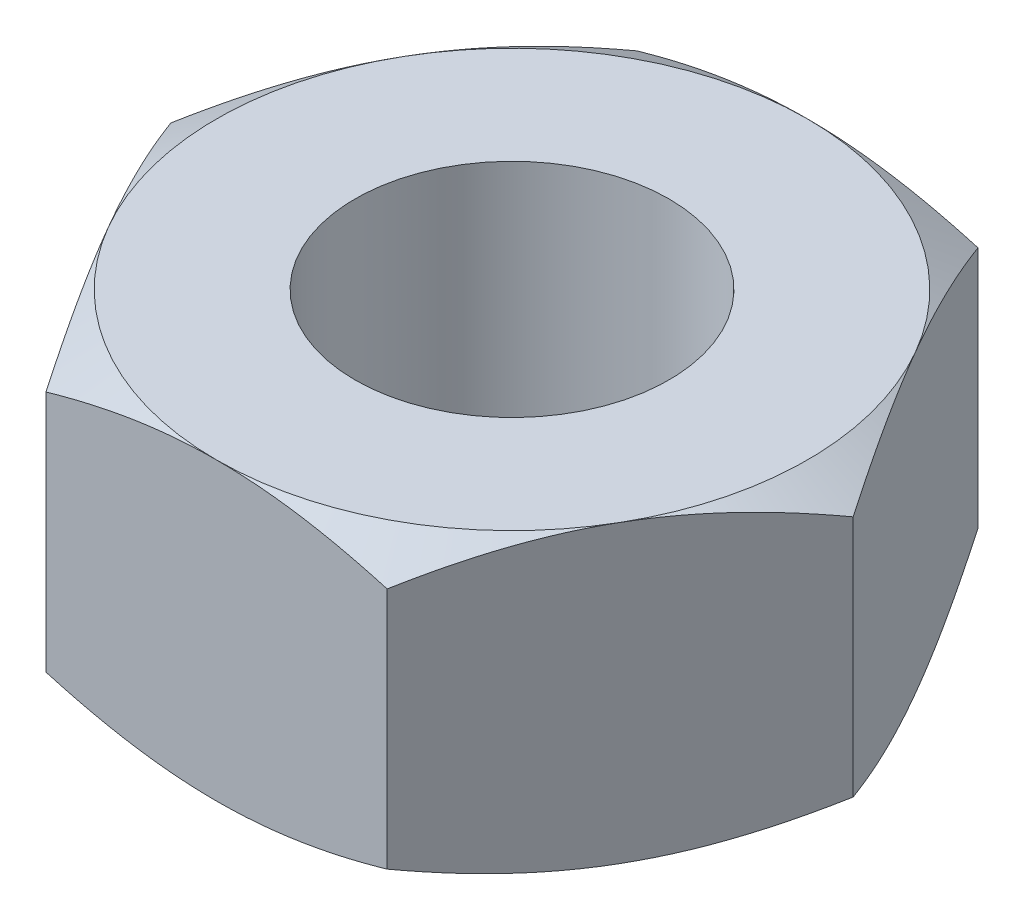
from build123d import *

# Parameters (mm, degrees)
BOSS_EXTRUDE1_DEPTH     = 9.6
SKETCH2_OUTSIDE_W       = 63.598
SKETCH2_OUTSIDE_H       = 60.628
SKETCH2_OUTSIDE_R       = 9.6
CUT_EXTRUDE1_DEPTH      = 9.6
CUT_EXTRUDE1_DRAFT      = -60
SKETCH3_OUTSIDE_W       = 63.598
SKETCH3_OUTSIDE_H       = 60.628
SKETCH3_OUTSIDE_R       = 9.6
CUT_EXTRUDE2_DEPTH      = 9.6
CUT_EXTRUDE2_DRAFT      = -60
M12X1_75_TAPPED_HOLE1_D = 10.2


with BuildPart() as part:
    # Sketch1 → Boss-Extrude1 (new body)
    with BuildSketch(Plane(origin=(0, 0, 0), x_dir=(1, 0, 0), z_dir=(0, 1, 0))):
        Polygon((11.085125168, 0), (5.542562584, 9.6), (-5.542562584, 9.6), (-11.085125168, 0), (-5.542562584, -9.6), (5.542562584, -9.6), align=None)
    extrude(amount=BOSS_EXTRUDE1_DEPTH)


with BuildPart() as cut_extrude1_tool:
    # Sketch2 outside → Cut-Extrude1 (with draft: the straight prism first)
    with BuildSketch(Plane(origin=(0, 9.6, 0), x_dir=(1, 0, 0), z_dir=(0, 1, 0))):
        Rectangle(SKETCH2_OUTSIDE_W, SKETCH2_OUTSIDE_H)
        Circle(SKETCH2_OUTSIDE_R, mode=Mode.SUBTRACT)
    extrude(amount=-CUT_EXTRUDE1_DEPTH)
    # Cut-Extrude1: the draft: its side faces are tilted about the plane it starts from
    cut_extrude1_sides = [cut_extrude1_tool.faces().sort_by_distance(p)[0] for p in [
        (0, 4.8, 30.314),
        (31.799, 4.8, 0),
        (0, 4.8, -30.314),
        (-31.799, 4.8, 0),
        (-9.6, 4.8, 0),
    ]]
    draft(cut_extrude1_sides, Plane(origin=(0, 9.6, 0), x_dir=(1, 0, 0), z_dir=(0, 1, 0)), CUT_EXTRUDE1_DRAFT)


with BuildPart() as part_1:
    add(part.part)

    # Cut-Extrude1: cut by cut_extrude1_tool
    add(cut_extrude1_tool.part, mode=Mode.SUBTRACT)


with BuildPart() as cut_extrude2_tool:
    # Sketch3 outside → Cut-Extrude2 (with draft: the straight prism first)
    with BuildSketch(Plane.XZ):
        Rectangle(SKETCH3_OUTSIDE_W, SKETCH3_OUTSIDE_H)
        Circle(SKETCH3_OUTSIDE_R, mode=Mode.SUBTRACT)
    extrude(amount=-CUT_EXTRUDE2_DEPTH)
    # Cut-Extrude2: the draft: its side faces are tilted about the plane it starts from
    cut_extrude2_sides = [cut_extrude2_tool.faces().sort_by_distance(p)[0] for p in [
        (0, 4.8, -30.314),
        (31.799, 4.8, 0),
        (0, 4.8, 30.314),
        (-31.799, 4.8, 0),
        (-9.6, 4.8, 0),
    ]]
    draft(cut_extrude2_sides, Plane.XZ, CUT_EXTRUDE2_DRAFT)


with BuildPart() as part_2:
    add(part_1.part)

    # Cut-Extrude2: cut by cut_extrude2_tool
    add(cut_extrude2_tool.part, mode=Mode.SUBTRACT)

    # M12x1.75 Tapped Hole1 (through all)
    with Locations(Plane(origin=(0, 9.6, 0), x_dir=(1, 0, 0), z_dir=(0, 1, 0))):
        with Locations((0, 0)):
            Hole(M12X1_75_TAPPED_HOLE1_D / 2)


solid = part_2.part
